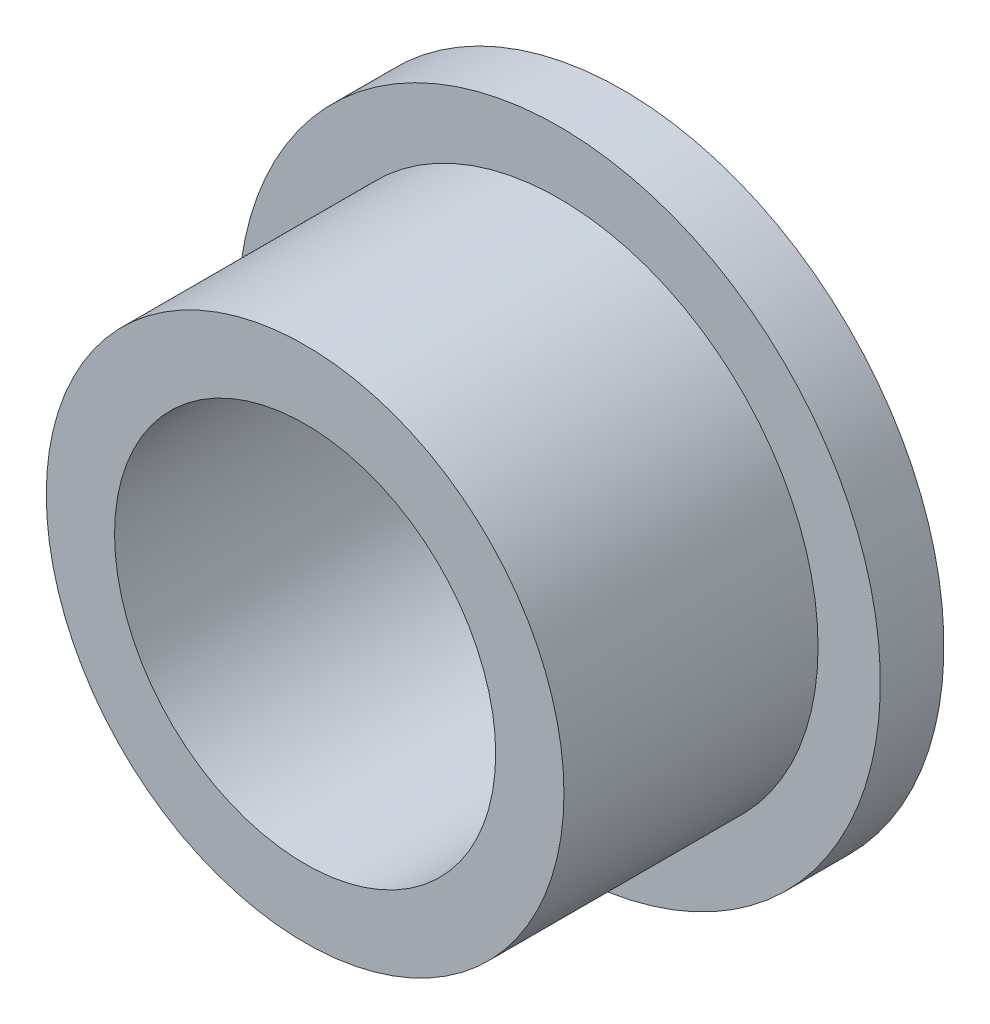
ISO-10303-21;
HEADER;
FILE_DESCRIPTION(('STEP AP214'),'2;1');
FILE_NAME('part.step','',(''),(''),'','','');
FILE_SCHEMA(('AUTOMOTIVE_DESIGN { 1 0 10303 214 1 1 1 1 }'));
ENDSEC;
DATA;
#1=APPLICATION_CONTEXT('core data for automotive mechanical design processes');
#2=APPLICATION_PROTOCOL_DEFINITION('international standard','automotive_design',2000,#1);
#3=PRODUCT_CONTEXT('',#1,'mechanical');
#4=PRODUCT('Part','Part','',(#3));
#5=PRODUCT_RELATED_PRODUCT_CATEGORY('part','',(#4));
#6=PRODUCT_DEFINITION_FORMATION('','',#4);
#7=PRODUCT_DEFINITION_CONTEXT('part definition',#1,'design');
#8=PRODUCT_DEFINITION('design','',#6,#7);
#9=PRODUCT_DEFINITION_SHAPE('','',#8);
#10=(LENGTH_UNIT() NAMED_UNIT(*) SI_UNIT(.MILLI.,.METRE.));
#11=(NAMED_UNIT(*) PLANE_ANGLE_UNIT() SI_UNIT($,.RADIAN.));
#12=(NAMED_UNIT(*) SI_UNIT($,.STERADIAN.) SOLID_ANGLE_UNIT());
#13=UNCERTAINTY_MEASURE_WITH_UNIT(LENGTH_MEASURE(1.E-05),#10,'distance_accuracy_value','');
#14=(GEOMETRIC_REPRESENTATION_CONTEXT(3) GLOBAL_UNCERTAINTY_ASSIGNED_CONTEXT((#13)) GLOBAL_UNIT_ASSIGNED_CONTEXT((#10,
#11,#12)) REPRESENTATION_CONTEXT('',''));
#15=CARTESIAN_POINT('',(0.,0.,0.));
#16=DIRECTION('',(0.,0.,1.));
#17=DIRECTION('',(1.,0.,0.));
#18=AXIS2_PLACEMENT_3D('',#15,#16,#17);
#19=CARTESIAN_POINT('',(0.,0.,5.));
#20=DIRECTION('',(0.,0.,-1.));
#21=DIRECTION('',(-1.,0.,0.));
#22=AXIS2_PLACEMENT_3D('',#19,#20,#21);
#23=CYLINDRICAL_SURFACE('',#22,4.075);
#24=CARTESIAN_POINT('',(0.,0.,5.));
#25=DIRECTION('',(0.,0.,1.));
#26=DIRECTION('',(1.,0.,0.));
#27=AXIS2_PLACEMENT_3D('',#24,#25,#26);
#28=CIRCLE('',#27,4.075);
#29=CARTESIAN_POINT('',(4.075,0.,5.));
#30=VERTEX_POINT('',#29);
#31=EDGE_CURVE('E47',#30,#30,#28,.T.);
#32=ORIENTED_EDGE('',*,*,#31,.F.);
#33=EDGE_LOOP('',(#32));
#34=FACE_BOUND('',#33,.T.);
#35=CARTESIAN_POINT('',(0.,0.,1.));
#36=DIRECTION('',(0.,0.,-1.));
#37=DIRECTION('',(-1.,0.,0.));
#38=AXIS2_PLACEMENT_3D('',#35,#36,#37);
#39=CIRCLE('',#38,4.075);
#40=CARTESIAN_POINT('',(-4.075,0.,1.));
#41=VERTEX_POINT('',#40);
#42=EDGE_CURVE('E10',#41,#41,#39,.T.);
#43=ORIENTED_EDGE('',*,*,#42,.F.);
#44=EDGE_LOOP('',(#43));
#45=FACE_BOUND('',#44,.T.);
#46=ADVANCED_FACE('F41',(#34,#45),#23,.T.);
#47=CARTESIAN_POINT('',(0.,0.,5.));
#48=DIRECTION('',(0.,0.,1.));
#49=DIRECTION('',(1.,0.,0.));
#50=AXIS2_PLACEMENT_3D('',#47,#48,#49);
#51=PLANE('',#50);
#52=ORIENTED_EDGE('',*,*,#31,.T.);
#53=EDGE_LOOP('',(#52));
#54=FACE_BOUND('',#53,.T.);
#55=CARTESIAN_POINT('',(0.,0.,5.));
#56=DIRECTION('',(0.,0.,1.));
#57=DIRECTION('',(1.,0.,0.));
#58=AXIS2_PLACEMENT_3D('',#55,#56,#57);
#59=CIRCLE('',#58,3.);
#60=CARTESIAN_POINT('',(3.,0.,5.));
#61=VERTEX_POINT('',#60);
#62=EDGE_CURVE('E51',#61,#61,#59,.T.);
#63=ORIENTED_EDGE('',*,*,#62,.F.);
#64=EDGE_LOOP('',(#63));
#65=FACE_BOUND('',#64,.T.);
#66=ADVANCED_FACE('F79',(#54,#65),#51,.T.);
#67=CARTESIAN_POINT('',(0.,0.,0.));
#68=DIRECTION('',(0.,0.,1.));
#69=DIRECTION('',(1.,0.,0.));
#70=AXIS2_PLACEMENT_3D('',#67,#68,#69);
#71=PLANE('',#70);
#72=CARTESIAN_POINT('',(0.,0.,0.));
#73=DIRECTION('',(0.,0.,1.));
#74=DIRECTION('',(1.,0.,0.));
#75=AXIS2_PLACEMENT_3D('',#72,#73,#74);
#76=CIRCLE('',#75,3.);
#77=CARTESIAN_POINT('',(3.,0.,0.));
#78=VERTEX_POINT('',#77);
#79=EDGE_CURVE('E55',#78,#78,#76,.T.);
#80=ORIENTED_EDGE('',*,*,#79,.T.);
#81=EDGE_LOOP('',(#80));
#82=FACE_BOUND('',#81,.T.);
#83=CARTESIAN_POINT('',(0.,0.,0.));
#84=DIRECTION('',(0.,0.,-1.));
#85=DIRECTION('',(-1.,0.,0.));
#86=AXIS2_PLACEMENT_3D('',#83,#84,#85);
#87=CIRCLE('',#86,5.05621879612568);
#88=CARTESIAN_POINT('',(-5.05621879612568,0.,0.));
#89=VERTEX_POINT('',#88);
#90=EDGE_CURVE('E61',#89,#89,#87,.T.);
#91=ORIENTED_EDGE('',*,*,#90,.T.);
#92=EDGE_LOOP('',(#91));
#93=FACE_BOUND('',#92,.T.);
#94=ADVANCED_FACE('F86',(#82,#93),#71,.F.);
#95=CARTESIAN_POINT('',(0.,0.,5.));
#96=DIRECTION('',(0.,0.,-1.));
#97=DIRECTION('',(-1.,0.,0.));
#98=AXIS2_PLACEMENT_3D('',#95,#96,#97);
#99=CYLINDRICAL_SURFACE('',#98,3.);
#100=ORIENTED_EDGE('',*,*,#62,.T.);
#101=EDGE_LOOP('',(#100));
#102=FACE_BOUND('',#101,.T.);
#103=ORIENTED_EDGE('',*,*,#79,.F.);
#104=EDGE_LOOP('',(#103));
#105=FACE_BOUND('',#104,.T.);
#106=ADVANCED_FACE('F76',(#102,#105),#99,.F.);
#107=CARTESIAN_POINT('',(0.,0.,1.));
#108=DIRECTION('',(0.,0.,-1.));
#109=DIRECTION('',(-1.,0.,0.));
#110=AXIS2_PLACEMENT_3D('',#107,#108,#109);
#111=CYLINDRICAL_SURFACE('',#110,5.05621879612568);
#112=CARTESIAN_POINT('',(0.,0.,1.));
#113=DIRECTION('',(0.,0.,-1.));
#114=DIRECTION('',(-1.,0.,0.));
#115=AXIS2_PLACEMENT_3D('',#112,#113,#114);
#116=CIRCLE('',#115,5.05621879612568);
#117=CARTESIAN_POINT('',(-5.05621879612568,0.,1.));
#118=VERTEX_POINT('',#117);
#119=EDGE_CURVE('E59',#118,#118,#116,.T.);
#120=ORIENTED_EDGE('',*,*,#119,.T.);
#121=EDGE_LOOP('',(#120));
#122=FACE_BOUND('',#121,.T.);
#123=ORIENTED_EDGE('',*,*,#90,.F.);
#124=EDGE_LOOP('',(#123));
#125=FACE_BOUND('',#124,.T.);
#126=ADVANCED_FACE('F67',(#122,#125),#111,.T.);
#127=CARTESIAN_POINT('',(0.,0.,1.));
#128=DIRECTION('',(0.,0.,-1.));
#129=DIRECTION('',(-1.,0.,0.));
#130=AXIS2_PLACEMENT_3D('',#127,#128,#129);
#131=PLANE('',#130);
#132=ORIENTED_EDGE('',*,*,#42,.T.);
#133=EDGE_LOOP('',(#132));
#134=FACE_BOUND('',#133,.T.);
#135=ORIENTED_EDGE('',*,*,#119,.F.);
#136=EDGE_LOOP('',(#135));
#137=FACE_BOUND('',#136,.T.);
#138=ADVANCED_FACE('F70',(#134,#137),#131,.F.);
#139=CLOSED_SHELL('',(#46,#66,#94,#106,#126,#138));
#140=MANIFOLD_SOLID_BREP('B2',#139);
#141=ADVANCED_BREP_SHAPE_REPRESENTATION('',(#18,#140),#14);
#142=SHAPE_DEFINITION_REPRESENTATION(#9,#141);
ENDSEC;
END-ISO-10303-21;
